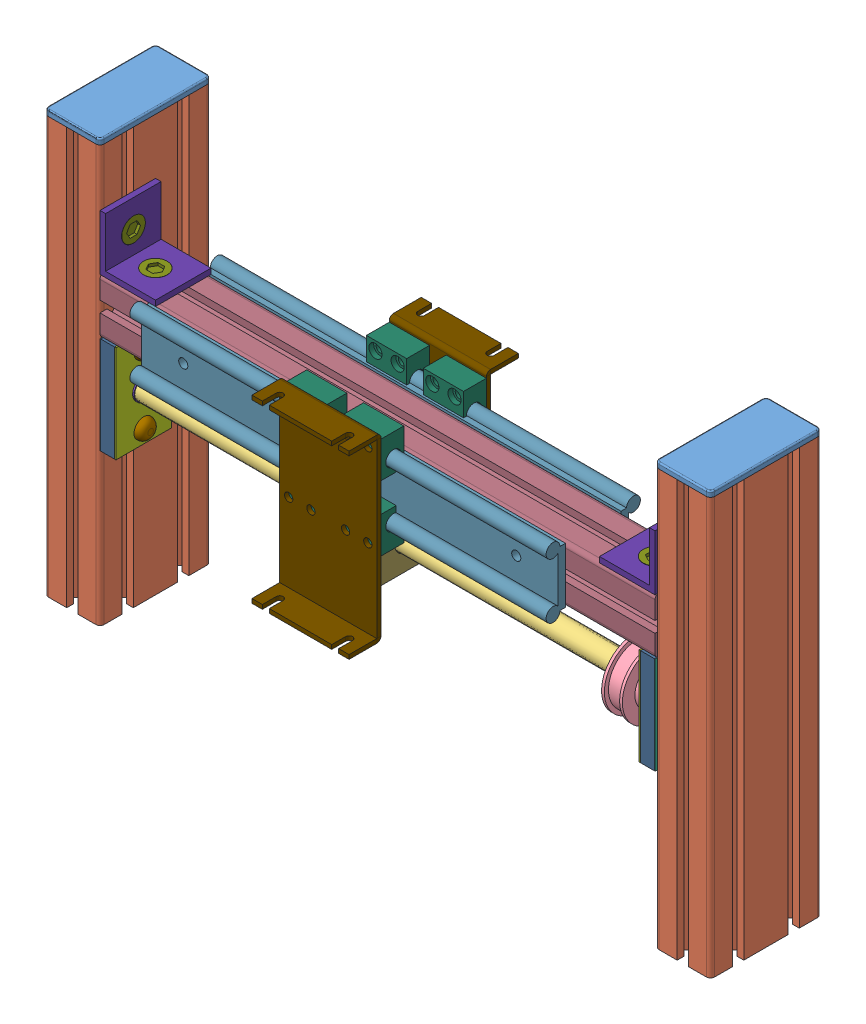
SolidWorks assembly Y-1-Final.SLDASM, configuration Predeterminado (file format 3800). Lengths in mm.
Overall size (480 304 122).
59 component instances, 18 part files, 0 mates.
Components (placement in the parent):
- Y-1-Base + Eje (sin soporte Z) -1: Y-1-Base + Eje (sin soporte Z) .SLDASM [Predeterminado] at (3.5621 93.9169 0) size (480 304 98)
  - Y-Tapa Perfil AL 40x80-1: Y-Tapa Perfil AL 40x80.SLDPRT [Predeterminado] at (260 100 0) x (0 0 -1) z (0 1 0) size (80 40 4)
  - Y-Tapa Perfil AL 40x80-2: Y-Tapa Perfil AL 40x80.SLDPRT [Predeterminado] at (-180 100 0) x (0 0 -1) z (0 1 0) size (80 40 4)
  - Y-1-Base + Eje (sin tapas ni soporte Z) -2: Y-1-Base + Eje (sin tapas ni soporte Z) .SLDASM [Predeterminado] at origin size (480 300 98)
    - Y-Pervil AL estructura 4x8x300-1: Y-Pervil AL estructura 4x8x300.SLDPRT [Predeterminado] at (260 100 -40) x (0 0 1) z (0 -1 0) size (80 40 300)
    - Y-Pervil AL estructura 4x8x300-2: Y-Pervil AL estructura 4x8x300.SLDPRT [Predeterminado] at (-180 100 -40) x (0 0 1) z (0 -1 0) size (80 40 300)
    - Y-Husillo con apollos y tureca-1: Y-Husillo con apollos y tureca.SLDASM [Predeterminado] at (-147.5 -55 0) x (0 1 0) z (1 0 0) size (70 62 417)
      - Y-Husillo con apollos-1: Y-Husillo con apollos.SLDASM [Predeterminado] at origin size (70 48 417)
        - Y-Husillo-1: Y-Husillo.SLDPRT [Predeterminado] at origin size (15 15 397)
        - Y-Polea (26 XL 037)-1: Y-Polea (26 XL 037).SLDPRT [Predeterminado] at (0 0 353) x (1 0 0) z (0 -1 0) size (48 22 48)
        - Y-Rodamiento completo-1: Y-Rodamiento completo.SLDASM [Predeterminado] at (0 0 -2) size (70 40 25)
          - Y-Apollo Soporte-1: Y-Apollo Soporte.SLDPRT [Predeterminado] at (0 0 -10) x (-1 0 0) z (0 0 -1) size (70 40 0.5)
          - Y-Protector completo fino-1: Y-Protector completo fino.SLDPRT [Predeterminado] at (0 0 -10.5) x (-1 0 0) z (0 0 -1) size (70 40 0.1)
          - Y-Protector con agujero-1: Y-Protector con agujero.SLDPRT [Predeterminado] at (0 0 1) x (-1 0 0) z (0 0 -1) size (70 40 1)
          - Y-Funda ()-1: Y-Funda ().SLDPRT [Predeterminado] at (0 0 2) x (-1 0 0) z (0 0 -1) size (16 16 10)
          - Y-Rodamiento con soporte y tornillo-1: Y-Rodamiento con soporte y tornillo.SLDASM [Predeterminado] at (0 0 0.5) size (70 40 25)
            - Y-Tornillo M8 x20-2: Y-Tornillo M8 x20.SLDPRT [Predeterminado] at (-25 0 5.5) x (-1 0 0) z (0 0 -1) size (14 14 25)
            - Y-Tornillo M8 x20-1: Y-Tornillo M8 x20.SLDPRT [Predeterminado] at (25 0 5.5) x (-1 0 0) z (0 0 -1) size (14 14 25)
            - Y-Rodamiento con soporte-1: Y-Rodamiento con soporte.SLDASM [Predeterminado] at (0 0 -10.5) size (70 40 10)
              - Y-Soporte rodamiento-1: Y-Soporte rodamiento.SLDPRT [Predeterminado] at origin size (70 40 10)
              - Y-Rodamiento (7201.2RS.TVP)-1: Y-Rodamiento (7201.2RS.TVP).SLDPRT [Predeterminado] at origin size (32 32 10)
        - Y-Rodamiento completo-2: Y-Rodamiento completo.SLDASM [Predeterminado] at (0 0 377) x (-1 0 0) z (0 0 -1) size (70 40 25)
          - Y-Apollo Soporte-1: Y-Apollo Soporte.SLDPRT [Predeterminado] at (0 0 -10) x (-1 0 0) z (0 0 -1) size (70 40 0.5)
          - Y-Protector completo fino-1: Y-Protector completo fino.SLDPRT [Predeterminado] at (0 0 -10.5) x (-1 0 0) z (0 0 -1) size (70 40 0.1)
          - Y-Protector con agujero-1: Y-Protector con agujero.SLDPRT [Predeterminado] at (0 0 1) x (-1 0 0) z (0 0 -1) size (70 40 1)
          - Y-Funda ()-1: Y-Funda ().SLDPRT [Predeterminado] at (0 0 2) x (-1 0 0) z (0 0 -1) size (16 16 10)
          - Y-Rodamiento con soporte y tornillo-1: Y-Rodamiento con soporte y tornillo.SLDASM [Predeterminado] at (0 0 0.5) size (70 40 25)
            - Y-Tornillo M8 x20-2: Y-Tornillo M8 x20.SLDPRT [Predeterminado] at (-25 0 5.5) x (-1 0 0) z (0 0 -1) size (14 14 25)
            - Y-Tornillo M8 x20-1: Y-Tornillo M8 x20.SLDPRT [Predeterminado] at (25 0 5.5) x (-1 0 0) z (0 0 -1) size (14 14 25)
            - Y-Rodamiento con soporte-1: Y-Rodamiento con soporte.SLDASM [Predeterminado] at (0 0 -10.5) size (70 40 10)
              - Y-Soporte rodamiento-1: Y-Soporte rodamiento.SLDPRT [Predeterminado] at origin size (70 40 10)
              - Y-Rodamiento (7201.2RS.TVP)-1: Y-Rodamiento (7201.2RS.TVP).SLDPRT [Predeterminado] at origin size (32 32 10)
      - Y-Turerca nylon-1: Y-Turerca nylon.SLDPRT [Predeterminado] at (0 20 173) x (1 0 0) z (0 -1 0) size (40 30 58)
    - Y-Soprte deslizaderas-1: Y-Soprte deslizaderas.SLDASM [Predeterminado] at (175 0 0) x (0 0 -1) z (1 0 0) size (76 73 400)
      - Y-Pervil AL estructura 4x4x400-1: Y-Pervil AL estructura 4x4x400.SLDPRT [Predeterminado] at (0 0 65) x (0 1 0) z (0 0 -1) size (40 40 400)
      - Y-Deslizaderas con patines-1: Y-Deslizaderas con patines.SLDASM [Predeterminado] at (0 0 -299.5) x (1 0 0) z (0 0 -1) size (18 73 300)
        - Y-Deslizadera doble-1: Y-Deslizadera doble.SLDPRT [Predeterminado] at (-22.75 0 0) x (0 -1 0) z (0 0 -1) size (50 14 300)
        - Y-Patin-1: Y-Patin.SLDPRT [Predeterminado] at (-29.75 -23.5 -185) x (0 1 0) z (0 0 1) size (26 16.5 29)
        - Y-Patin-3: Y-Patin.SLDPRT [Predeterminado] at (-29.75 23.5 -156) x (0 -1 0) z (0 0 -1) size (26 16.5 29)
        - Y-Patin-4: Y-Patin.SLDPRT [Predeterminado] at (-29.75 23.5 -115) x (0 -1 0) z (0 0 -1) size (26 16.5 29)
        - Y-Patin-6: Y-Patin.SLDPRT [Predeterminado] at (-29.75 -23.5 -144) x (0 1 0) z (0 0 1) size (26 16.5 29)
      - Y-Deslizaderas con patines-2: Y-Deslizaderas con patines.SLDASM [Predeterminado] at (0 0 0.5) x (-1 0 0) z (0 0 1) size (18 73 300)
        - Y-Deslizadera doble-1: Y-Deslizadera doble.SLDPRT [Predeterminado] at (-22.75 0 0) x (0 -1 0) z (0 0 -1) size (50 14 300)
        - Y-Patin-1: Y-Patin.SLDPRT [Predeterminado] at (-29.75 -23.5 -185) x (0 1 0) z (0 0 1) size (26 16.5 29)
        - Y-Patin-3: Y-Patin.SLDPRT [Predeterminado] at (-29.75 23.5 -156) x (0 -1 0) z (0 0 -1) size (26 16.5 29)
        - Y-Patin-4: Y-Patin.SLDPRT [Predeterminado] at (-29.75 23.5 -115) x (0 -1 0) z (0 0 -1) size (26 16.5 29)
        - Y-Patin-6: Y-Patin.SLDPRT [Predeterminado] at (-29.75 -23.5 -144) x (0 1 0) z (0 0 1) size (26 16.5 29)
    - Y-Angulo con tornillos-2: Y-Angulo con tornillos.SLDASM [Predeterminado] at (-160 20 -20) size (55.92 55.89 40)
      - Y-Tornillo M8 x16-1: Y-Tornillo M8 x16.SLDPRT [Predeterminado] at (19.9756 -15.8873 20.1118) size (17 20 17)
      - Y-Angulo 40x40 L (0.0.196.87)-1: Y-Angulo 40x40 L (0.0.196.87).SLDPRT [Predeterminado] at origin size (40 40 40)
      - Y-Tornillo M8 x16-2: Y-Tornillo M8 x16.SLDPRT [Predeterminado] at (-15.9177 20.1326 19.8969) x (0 0 1) z (0 1 0) size (17 20 17)
    - Y-Angulo con tornillos-1: Y-Angulo con tornillos.SLDASM [Predeterminado] at (240 20 -20) x (0 1 0) z (0 0 1) size (55.92 55.89 40)
      - Y-Tornillo M8 x16-1: Y-Tornillo M8 x16.SLDPRT [Predeterminado] at (19.9756 -15.8873 20.1118) size (17 20 17)
      - Y-Angulo 40x40 L (0.0.196.87)-1: Y-Angulo 40x40 L (0.0.196.87).SLDPRT [Predeterminado] at origin size (40 40 40)
      - Y-Tornillo M8 x16-2: Y-Tornillo M8 x16.SLDPRT [Predeterminado] at (-15.9177 20.1326 19.8969) x (0 0 1) z (0 1 0) size (17 20 17)
- Y-Soporte Eje Z -1: Y-Soporte Eje Z .SLDPRT [Predeterminado] at (64.06 67.42 38) x (-1 0 0) z (0 0 1) size (70 130 23)
- Y-Soporte Eje Z -2: Y-Soporte Eje Z .SLDPRT [Predeterminado] at (-5.94 67.42 -38) x (1 0 0) z (0 0 -1) size (70 130 23)
- Y-Tapa Perfil AL 40x80-1: Y-Tapa Perfil AL 40x80.SLDPRT [Predeterminado] at (-176.434 193.92 -0.0015) x (0 0 -1) z (0 1 0) size (80 40 4)
- Y-Tapa Perfil AL 40x80-2: Y-Tapa Perfil AL 40x80.SLDPRT [Predeterminado] at (263.564 193.92 -39.997) x (0 0 1) z (0 1 0) size (80 40 4)
